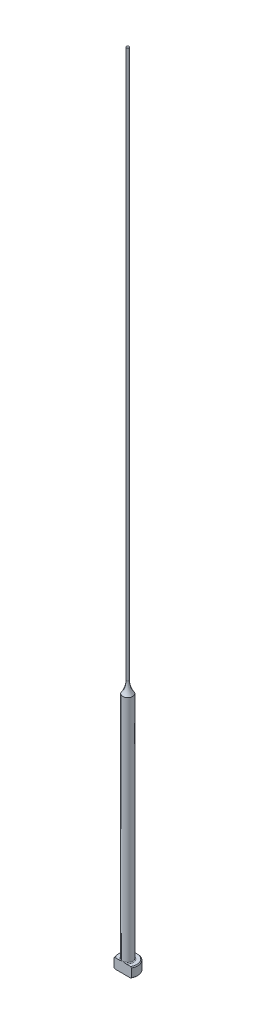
from build123d import *

# Parameters (mm, degrees)
CHAMFER1_SIZE = 0.254
FILLET1_R     = 0.254
KEY_DEPTH     = 255.0396844


with BuildPart() as part:
    # Sketch1 → Revolve1 (revolve)
    with BuildSketch(Plane.XY, mode=Mode.PRIVATE) as revolve1_sk:
        with BuildLine():
            Line((0, 0), (-3.175, 0))
            Line((-3.175, 0), (-3.175, 3.175))
            Line((-3.175, 3.175), (-1.5875, 3.175))
            Line((-1.5875, 3.175), (-1.5875, 76.2))
            ThreePointArc((-1.5875, 76.2), (-0.701386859, 77.957887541), (-0.39624, 79.90268843))
            Line((-0.39624, 79.90268843), (-0.39624, 254))
            Line((-0.39624, 254), (0, 254))
            Line((0, 254), (0, 0))
        make_face()
    revolve(revolve1_sk.sketch.rotate(Axis((0, 259.958771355, 0), (0, -1, 0)), 270), axis=Axis((0, 259.958771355, 0), (0, -1, 0)))

    # Chamfer1
    chamfer1_edges = [part.edges().sort_by_distance(p)[0] for p in [
        (0, 0, -3.175),
        (0, 3.175, -3.175),
    ]]
    chamfer(chamfer1_edges, length=CHAMFER1_SIZE)

    # Fillet1
    fillet1_edges = [part.edges().sort_by_distance(p)[0] for p in [
        (0, 3.175, -1.5875),
    ]]
    fillet(fillet1_edges, radius=FILLET1_R)

    # Sketch2 → KEY (cut, through all)
    with BuildSketch(Plane.XZ):
        with BuildLine():
            Line((-2.749630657, 1.5875), (2.749630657, 1.5875))
            ThreePointArc((2.749630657, 1.5875), (0, 3.175), (-2.749630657, 1.5875))
        make_face()
    extrude(amount=-KEY_DEPTH, mode=Mode.SUBTRACT)


solid = part.part
